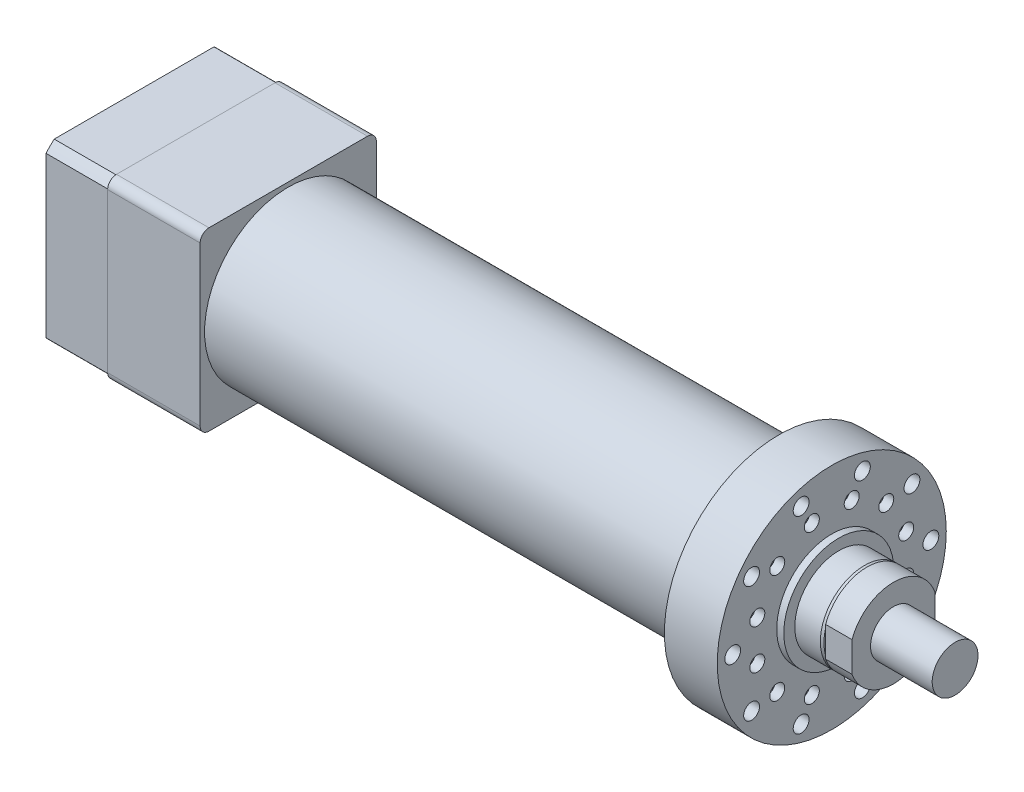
from build123d import *

# Parameters (mm, degrees)
SKETCH_1_R          = 95
SKETCH_1_R_2        = 80
EXTRUDE_1_DEPTH     = 557
SKETCH_2_R          = 130
EXTRUDE_2_DEPTH     = 60
SKETCH_3_R          = 62.5
EXTRUDE_3_DEPTH     = 8
SKETCH_4_R          = 5.5
SKETCH_4_R_2        = 9
CUT_EXTRUDE_1_DEPTH = 60
SKETCH_5_R          = 13
CUT_EXTRUDE_2_DEPTH = 17
SKETCH_4_3_R        = 8.5
CUT_EXTRUDE_3_DEPTH = 11
SKETCH_6_R          = 50
EXTRUDE_4_DEPTH     = 32
CHAMFER_1_SIZE      = 3
CHAMFER_1_SIZE2     = 1.091910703
EXTRUDE_5_DEPTH     = 30
SKETCH_8_R          = 26
CUT_EXTRUDE_4_DEPTH = 82
EXTRUDE_6_DEPTH     = 105
EXTRUDE_7_DEPTH     = 70
SKETCH_11_R         = 65
CUT_EXTRUDE_5_DEPTH = 30
SKETCH_12_R         = 55
CUT_EXTRUDE_6_DEPTH = 31
SKETCH_13_R         = 5
CUT_EXTRUDE_7_DEPTH = 20
SKETCH_13_4_R       = 5.5
CUT_EXTRUDE_8_DEPTH = 70
SKETCH_13_5_R       = 8.5
CUT_EXTRUDE_9_DEPTH = 12
EXTRUDE_START       = 70
SKETCH_14_R         = 26
EXTRUDE_8_DEPTH     = 70


with BuildPart() as part:
    # Sketch 1 → Extrude 1 (new body)
    with BuildSketch(Plane(origin=(0, 0, 0), x_dir=(0, 0, -1), z_dir=(1, 0, 0))):
        Circle(SKETCH_1_R)
        Circle(SKETCH_1_R_2, mode=Mode.SUBTRACT)
    extrude(amount=EXTRUDE_1_DEPTH)

    # Sketch 2 → Extrude 2 (add)
    with BuildSketch(Plane(origin=(557, 0, 0), x_dir=(0, 0, -1), z_dir=(1, 0, 0))):
        Circle(SKETCH_2_R)
    extrude(amount=EXTRUDE_2_DEPTH)

    # Sketch 3 → Extrude 3 (add)
    with BuildSketch(Plane(origin=(617, 0, 0), x_dir=(0, 0, -1), z_dir=(1, 0, 0))):
        Circle(SKETCH_3_R)
    extrude(amount=EXTRUDE_3_DEPTH)

    # Sketch 4 → Cut-Extrude 1 (cut)
    with BuildSketch(Plane(origin=(617, 0, 0), x_dir=(0, 0, -1), z_dir=(1, 0, 0))):
        with Locations((61.871843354, 61.871843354)):
            Circle(SKETCH_4_R)
        with Locations((91.014411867, 66.125840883)):
            Circle(SKETCH_4_R_2)
        with Locations((84.5185098, 22.646666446)):
            Circle(SKETCH_4_R)
        with Locations((34.764411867, 106.993858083)):
            Circle(SKETCH_4_R_2)
        with Locations((22.646666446, 84.5185098)):
            Circle(SKETCH_4_R)
        with Locations((112.5, 0)):
            Circle(SKETCH_4_R_2)
        with Locations((84.5185098, -22.646666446)):
            Circle(SKETCH_4_R)
        with Locations((91.014411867, -66.125840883)):
            Circle(SKETCH_4_R_2)
        with Locations((61.871843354, -61.871843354)):
            Circle(SKETCH_4_R)
        with Locations((22.646666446, -84.5185098)):
            Circle(SKETCH_4_R)
        with Locations((34.764411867, -106.993858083)):
            Circle(SKETCH_4_R_2)
        with Locations((-34.764411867, -106.993858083)):
            Circle(SKETCH_4_R_2)
        with Locations((-22.646666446, -84.5185098)):
            Circle(SKETCH_4_R)
        with Locations((-61.871843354, -61.871843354)):
            Circle(SKETCH_4_R)
        with Locations((-91.014411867, -66.125840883)):
            Circle(SKETCH_4_R_2)
        with Locations((-112.5, 0)):
            Circle(SKETCH_4_R_2)
        with Locations((-84.5185098, -22.646666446)):
            Circle(SKETCH_4_R)
        with Locations((-84.5185098, 22.646666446)):
            Circle(SKETCH_4_R)
        with Locations((-61.871843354, 61.871843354)):
            Circle(SKETCH_4_R)
        with Locations((-91.014411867, 66.125840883)):
            Circle(SKETCH_4_R_2)
        with Locations((-22.646666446, 84.5185098)):
            Circle(SKETCH_4_R)
        with Locations((-34.764411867, 106.993858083)):
            Circle(SKETCH_4_R_2)
    extrude(amount=-CUT_EXTRUDE_1_DEPTH, mode=Mode.SUBTRACT)

    # Sketch 5 → Cut-Extrude 2 (cut)
    with BuildSketch(Plane.ZY.offset(-557)):
        with Locations((-34.764411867, 106.993858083)):
            Circle(SKETCH_5_R)
        with Locations((34.764411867, 106.993858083)):
            Circle(SKETCH_5_R)
        with Locations((91.014411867, 66.125840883)):
            Circle(SKETCH_5_R)
        with Locations((112.5, 0)):
            Circle(SKETCH_5_R)
        with Locations((91.014411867, -66.125840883)):
            Circle(SKETCH_5_R)
        with Locations((34.764411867, -106.993858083)):
            Circle(SKETCH_5_R)
        with Locations((-34.764411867, -106.993858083)):
            Circle(SKETCH_5_R)
        with Locations((-91.014411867, -66.125840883)):
            Circle(SKETCH_5_R)
        with Locations((-112.5, 0)):
            Circle(SKETCH_5_R)
        with Locations((-91.014411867, 66.125840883)):
            Circle(SKETCH_5_R)
    extrude(amount=-CUT_EXTRUDE_2_DEPTH, mode=Mode.SUBTRACT)

    # Sketch 4_3 → Cut-Extrude 3 (cut)
    with BuildSketch(Plane(origin=(617, 0, 0), x_dir=(0, 0, -1), z_dir=(1, 0, 0))):
        with Locations((-22.646666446, 84.5185098)):
            Circle(SKETCH_4_3_R)
        with Locations((22.646666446, 84.5185098)):
            Circle(SKETCH_4_3_R)
        with Locations((61.871843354, 61.871843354)):
            Circle(SKETCH_4_3_R)
        with Locations((84.5185098, 22.646666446)):
            Circle(SKETCH_4_3_R)
        with Locations((84.5185098, -22.646666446)):
            Circle(SKETCH_4_3_R)
        with Locations((61.871843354, -61.871843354)):
            Circle(SKETCH_4_3_R)
        with Locations((22.646666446, -84.5185098)):
            Circle(SKETCH_4_3_R)
        with Locations((-22.646666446, -84.5185098)):
            Circle(SKETCH_4_3_R)
        with Locations((-61.871843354, -61.871843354)):
            Circle(SKETCH_4_3_R)
        with Locations((-84.5185098, -22.646666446)):
            Circle(SKETCH_4_3_R)
        with Locations((-84.5185098, 22.646666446)):
            Circle(SKETCH_4_3_R)
        with Locations((-61.871843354, 61.871843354)):
            Circle(SKETCH_4_3_R)
    extrude(amount=-CUT_EXTRUDE_3_DEPTH, mode=Mode.SUBTRACT)

    # Sketch 6 → Extrude 4 (add)
    with BuildSketch(Plane(origin=(625, 0, 0), x_dir=(0, 0, -1), z_dir=(1, 0, 0))):
        Circle(SKETCH_6_R)
    extrude(amount=EXTRUDE_4_DEPTH)

    # Chamfer 1
    chamfer_1_edges = [part.edges().sort_by_distance(p)[0] for p in [
        (657, 0, 50),
    ]]
    chamfer_1_side = [part.faces().sort_by_distance(p)[0] for p in [
        (641, 0, 50),
    ]]
    chamfer(chamfer_1_edges, length=CHAMFER_1_SIZE, length2=CHAMFER_1_SIZE2, reference=chamfer_1_side[0])

    # Sketch 7 → Extrude 5 (add)
    with BuildSketch(Plane(origin=(657, 0, 0), x_dir=(0, 0, -1), z_dir=(1, 0, 0))):
        with BuildLine():
            Line((-47, 17.058722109), (-47, -17.058722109))
            ThreePointArc((-47, -17.058722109), (0, -50), (47, -17.058722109))
            Line((47, -17.058722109), (47, 17.058722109))
            ThreePointArc((47, 17.058722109), (0, 50), (-47, 17.058722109))
        make_face()
    extrude(amount=EXTRUDE_5_DEPTH)

    # Sketch 8 → Cut-Extrude 4 (cut)
    with BuildSketch(Plane(origin=(687, 0, 0), x_dir=(0, 0, -1), z_dir=(1, 0, 0))):
        Circle(SKETCH_8_R)
    extrude(amount=-CUT_EXTRUDE_4_DEPTH, mode=Mode.SUBTRACT)

    # Sketch 9 → Extrude 6 (add)
    with BuildSketch(Plane.ZY):
        with BuildLine():
            Line((-90, 100), (90, 100))
            ThreePointArc((90, 100), (97.071067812, 97.071067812), (100, 90))
            Line((100, 90), (100, -90))
            ThreePointArc((100, -90), (97.071067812, -97.071067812), (90, -100))
            Line((90, -100), (-90, -100))
            ThreePointArc((-90, -100), (-97.071067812, -97.071067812), (-100, -90))
            Line((-100, -90), (-100, 90))
            ThreePointArc((-100, 90), (-97.071067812, 97.071067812), (-90, 100))
        make_face()
    extrude(amount=EXTRUDE_6_DEPTH)


with BuildPart() as body_2:
    # Sketch 10 → Extrude 7 (new body)
    with BuildSketch(Plane.ZY.offset(105)):
        with BuildLine():
            Line((-90.691785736, 100), (90.691785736, 100))
            ThreePointArc((90.691785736, 100), (95.45941546, 95.45941546), (100, 90.691785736))
            Line((100, 90.691785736), (100, -90.691785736))
            ThreePointArc((100, -90.691785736), (95.45941546, -95.45941546), (90.691785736, -100))
            Line((90.691785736, -100), (-90.691785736, -100))
            ThreePointArc((-90.691785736, -100), (-95.45941546, -95.45941546), (-100, -90.691785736))
            Line((-100, -90.691785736), (-100, 90.691785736))
            ThreePointArc((-100, 90.691785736), (-95.45941546, 95.45941546), (-90.691785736, 100))
        make_face()
    extrude(amount=EXTRUDE_7_DEPTH)

    # Sketch 11 → Cut-Extrude 5 (cut)
    with BuildSketch(Plane.ZY.offset(175)):
        Circle(SKETCH_11_R)
    extrude(amount=-CUT_EXTRUDE_5_DEPTH, mode=Mode.SUBTRACT)

    # Sketch 12 → Cut-Extrude 6 (cut)
    with BuildSketch(Plane.ZY.offset(145)):
        Circle(SKETCH_12_R)
    extrude(amount=-CUT_EXTRUDE_6_DEPTH, mode=Mode.SUBTRACT)

    # Sketch 13 → Cut-Extrude 7 (cut)
    with BuildSketch(Plane.ZY.offset(175)):
        with Locations((-58.336309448, 58.336309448)):
            Circle(SKETCH_13_R)
        with Locations((58.336309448, 58.336309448)):
            Circle(SKETCH_13_R)
        with Locations((58.336309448, -58.336309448)):
            Circle(SKETCH_13_R)
        with Locations((-58.336309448, -58.336309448)):
            Circle(SKETCH_13_R)
    extrude(amount=-CUT_EXTRUDE_7_DEPTH, mode=Mode.SUBTRACT)

    # Sketch 13_4 → Cut-Extrude 8 (cut)
    with BuildSketch(Plane.ZY.offset(175)):
        with Locations((0, 87.5)):
            Circle(SKETCH_13_4_R)
        with Locations((43.75, 75.777222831)):
            Circle(SKETCH_13_4_R)
        with Locations((75.777222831, 43.75)):
            Circle(SKETCH_13_4_R)
        with Locations((87.5, 0)):
            Circle(SKETCH_13_4_R)
        with Locations((75.777222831, -43.75)):
            Circle(SKETCH_13_4_R)
        with Locations((43.75, -75.777222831)):
            Circle(SKETCH_13_4_R)
        with Locations((0, -87.5)):
            Circle(SKETCH_13_4_R)
        with Locations((-43.75, -75.777222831)):
            Circle(SKETCH_13_4_R)
        with Locations((-75.777222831, -43.75)):
            Circle(SKETCH_13_4_R)
        with Locations((-87.5, 0)):
            Circle(SKETCH_13_4_R)
        with Locations((-75.777222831, 43.75)):
            Circle(SKETCH_13_4_R)
        with Locations((-43.75, 75.777222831)):
            Circle(SKETCH_13_4_R)
    extrude(amount=-CUT_EXTRUDE_8_DEPTH, mode=Mode.SUBTRACT)

    # Sketch 13_5 → Cut-Extrude 9 (cut)
    with BuildSketch(Plane.ZY.offset(175)):
        with Locations((0, 87.5)):
            Circle(SKETCH_13_5_R)
        with Locations((43.75, 75.777222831)):
            Circle(SKETCH_13_5_R)
        with Locations((75.777222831, 43.75)):
            Circle(SKETCH_13_5_R)
        with Locations((87.5, 0)):
            Circle(SKETCH_13_5_R)
        with Locations((75.777222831, -43.75)):
            Circle(SKETCH_13_5_R)
        with Locations((43.75, -75.777222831)):
            Circle(SKETCH_13_5_R)
        with Locations((0, -87.5)):
            Circle(SKETCH_13_5_R)
        with Locations((-43.75, -75.777222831)):
            Circle(SKETCH_13_5_R)
        with Locations((-75.777222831, -43.75)):
            Circle(SKETCH_13_5_R)
        with Locations((-87.5, 0)):
            Circle(SKETCH_13_5_R)
        with Locations((-75.777222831, 43.75)):
            Circle(SKETCH_13_5_R)
        with Locations((-43.75, 75.777222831)):
            Circle(SKETCH_13_5_R)
    extrude(amount=-CUT_EXTRUDE_9_DEPTH, mode=Mode.SUBTRACT)


with BuildPart() as body_3:
    # Sketch 14 → Extrude 8 (new body)
    with BuildSketch(Plane(origin=(687, 0, 0), x_dir=(0, 0, -1), z_dir=(1, 0, 0)).offset(EXTRUDE_START)):
        Circle(SKETCH_14_R)
    extrude(amount=-EXTRUDE_8_DEPTH)


solid = Compound([part.part, body_2.part, body_3.part])
